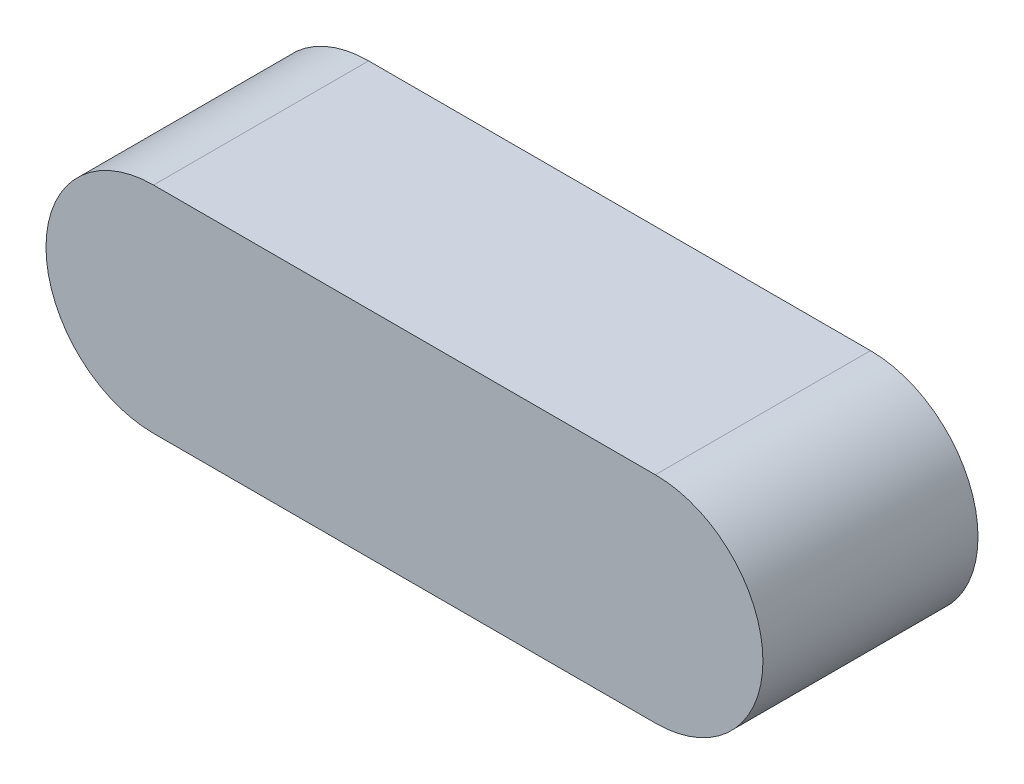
from build123d import *

# Parameters (mm, degrees)
BOSS_EXTRU_1_DEPTH = 3


with BuildPart() as part:
    # Esquisse1 → Boss.-Extru.1 (new body)
    with BuildSketch(Plane.XY):
        with BuildLine():
            Line((0, 0), (7, 0))
            ThreePointArc((7, 0), (8.5, -1.5), (7, -3))
            Line((7, -3), (0, -3))
            ThreePointArc((0, -3), (-1.5, -1.5), (0, 0))
        make_face()
    extrude(amount=BOSS_EXTRU_1_DEPTH)


solid = part.part
